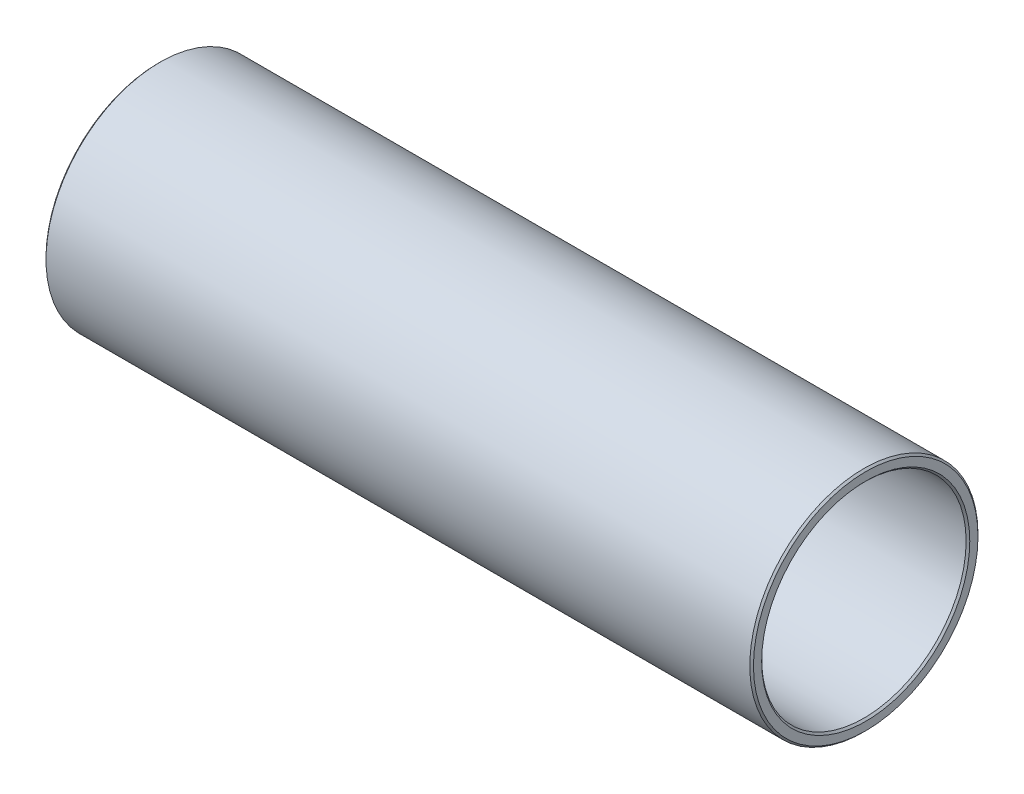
from build123d import *

# Parameters (mm, degrees)
SKETCH1_R                = 15.875
SKETCH1_R_2              = 14.224
F_1_1_4_X_065_TUBE_DEPTH = 98.425
CHAMFER1_SIZE            = 0.254


with BuildPart() as part:
    # Sketch1 → 1 1_4_ x .065 tube (new body)
    with BuildSketch(Plane(origin=(0, 0, 0), x_dir=(0, 0, -1), z_dir=(1, 0, 0))):
        Circle(SKETCH1_R)
        Circle(SKETCH1_R_2, mode=Mode.SUBTRACT)
    extrude(amount=F_1_1_4_X_065_TUBE_DEPTH)

    # Chamfer1
    chamfer1_edges = [part.edges().sort_by_distance(p)[0] for p in [
        (0, 0, 15.875),
        (98.425, 0, 15.875),
        (0, 0, 14.224),
        (98.425, 0, 14.224),
    ]]
    chamfer(chamfer1_edges, length=CHAMFER1_SIZE)


solid = part.part
